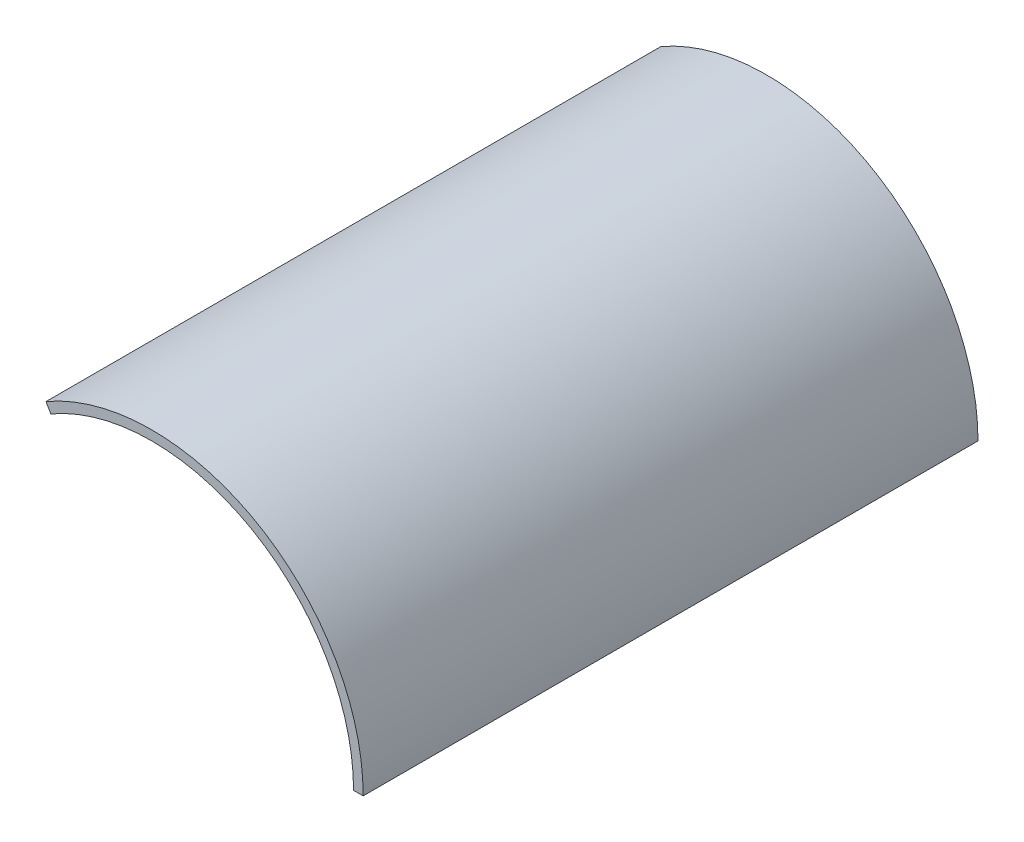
from build123d import *

# Parameters (mm, degrees)
SALIENTE_EXTRUIR1_DEPTH = 32


with BuildPart() as part:
    # Croquis1 → Saliente-Extruir1 (new body)
    with BuildSketch(Plane.XY):
        with BuildLine():
            ThreePointArc((-5.257663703, 9.088837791), (5.246166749, 9.095478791), (10.5, 0))
            Line((10.5, 0), (11, 0))
            ThreePointArc((11, 0), (5.495984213, 9.528596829), (-5.508028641, 9.52163959))
            Line((-5.508028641, 9.52163959), (-5.257663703, 9.088837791))
        make_face()
    extrude(amount=SALIENTE_EXTRUIR1_DEPTH)


solid = part.part
